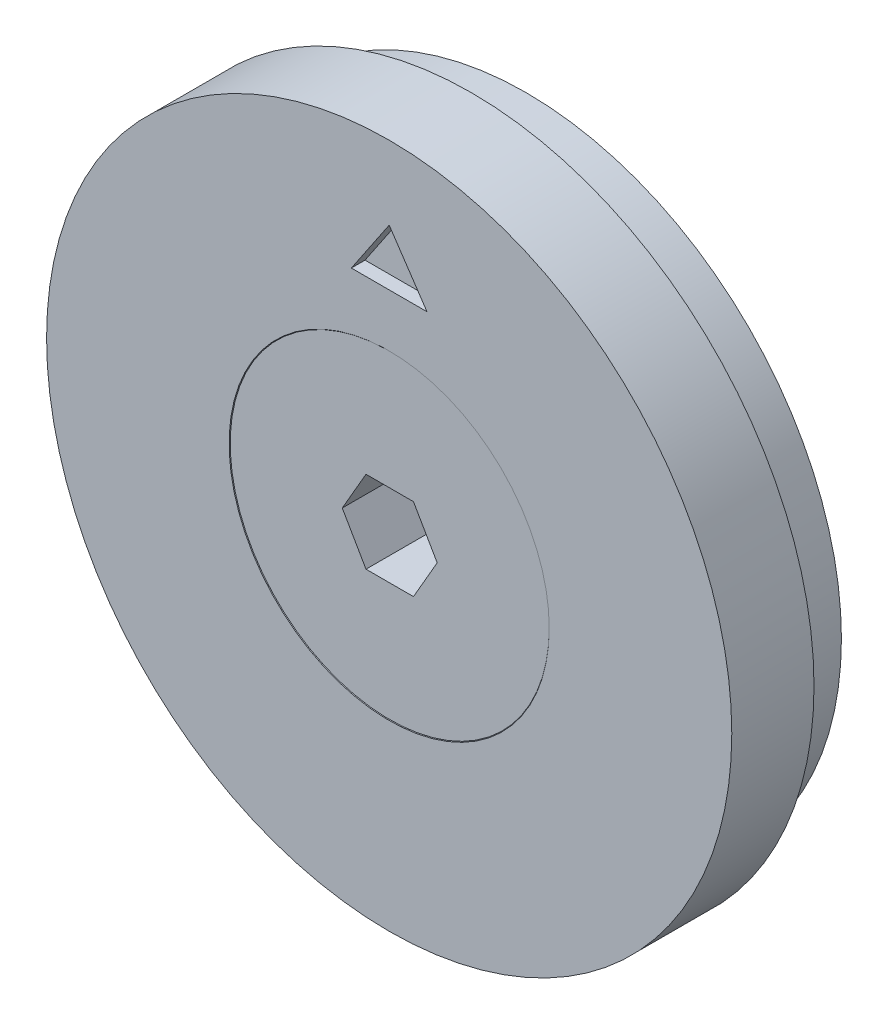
ISO-10303-21;
HEADER;
FILE_DESCRIPTION(('STEP AP214'),'2;1');
FILE_NAME('part.step','',(''),(''),'','','');
FILE_SCHEMA(('AUTOMOTIVE_DESIGN { 1 0 10303 214 1 1 1 1 }'));
ENDSEC;
DATA;
#1=APPLICATION_CONTEXT('core data for automotive mechanical design processes');
#2=APPLICATION_PROTOCOL_DEFINITION('international standard','automotive_design',2000,#1);
#3=PRODUCT_CONTEXT('',#1,'mechanical');
#4=PRODUCT('Part','Part','',(#3));
#5=PRODUCT_RELATED_PRODUCT_CATEGORY('part','',(#4));
#6=PRODUCT_DEFINITION_FORMATION('','',#4);
#7=PRODUCT_DEFINITION_CONTEXT('part definition',#1,'design');
#8=PRODUCT_DEFINITION('design','',#6,#7);
#9=PRODUCT_DEFINITION_SHAPE('','',#8);
#10=(LENGTH_UNIT() NAMED_UNIT(*) SI_UNIT(.MILLI.,.METRE.));
#11=(NAMED_UNIT(*) PLANE_ANGLE_UNIT() SI_UNIT($,.RADIAN.));
#12=(NAMED_UNIT(*) SI_UNIT($,.STERADIAN.) SOLID_ANGLE_UNIT());
#13=UNCERTAINTY_MEASURE_WITH_UNIT(LENGTH_MEASURE(1.E-05),#10,'distance_accuracy_value','');
#14=(GEOMETRIC_REPRESENTATION_CONTEXT(3) GLOBAL_UNCERTAINTY_ASSIGNED_CONTEXT((#13)) GLOBAL_UNIT_ASSIGNED_CONTEXT((#10,
#11,#12)) REPRESENTATION_CONTEXT('',''));
#15=CARTESIAN_POINT('',(0.,0.,0.));
#16=DIRECTION('',(0.,0.,1.));
#17=DIRECTION('',(1.,0.,0.));
#18=AXIS2_PLACEMENT_3D('',#15,#16,#17);
#19=CARTESIAN_POINT('',(0.,0.,-0.0199999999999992));
#20=DIRECTION('',(0.,0.,1.));
#21=DIRECTION('',(1.,0.,0.));
#22=AXIS2_PLACEMENT_3D('',#19,#20,#21);
#23=CYLINDRICAL_SURFACE('',#22,2.5);
#24=CARTESIAN_POINT('',(0.,0.,-3.34));
#25=DIRECTION('',(0.,0.,1.));
#26=DIRECTION('',(1.,0.,0.));
#27=AXIS2_PLACEMENT_3D('',#24,#25,#26);
#28=CIRCLE('',#27,2.5);
#29=CARTESIAN_POINT('',(2.5,0.,-3.34));
#30=VERTEX_POINT('',#29);
#31=EDGE_CURVE('P0_E11',#30,#30,#28,.T.);
#32=ORIENTED_EDGE('',*,*,#31,.F.);
#33=EDGE_LOOP('',(#32));
#34=FACE_BOUND('',#33,.T.);
#35=CARTESIAN_POINT('',(0.,0.,-9.77));
#36=DIRECTION('',(0.,0.,1.));
#37=DIRECTION('',(1.,0.,0.));
#38=AXIS2_PLACEMENT_3D('',#35,#36,#37);
#39=CIRCLE('',#38,2.5);
#40=CARTESIAN_POINT('',(2.5,0.,-9.77));
#41=VERTEX_POINT('',#40);
#42=EDGE_CURVE('P0_E136',#41,#41,#39,.T.);
#43=ORIENTED_EDGE('',*,*,#42,.T.);
#44=EDGE_LOOP('',(#43));
#45=FACE_BOUND('',#44,.T.);
#46=ADVANCED_FACE('P0_F35',(#34,#45),#23,.T.);
#47=CARTESIAN_POINT('',(0.,0.,-3.34));
#48=DIRECTION('',(0.,0.,1.));
#49=DIRECTION('',(1.,0.,0.));
#50=AXIS2_PLACEMENT_3D('',#47,#48,#49);
#51=CONICAL_SURFACE('',#50,2.5,0.785398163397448);
#52=CARTESIAN_POINT('',(0.,0.,-0.0199999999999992));
#53=DIRECTION('',(0.,0.,1.));
#54=DIRECTION('',(1.,0.,0.));
#55=AXIS2_PLACEMENT_3D('',#52,#53,#54);
#56=CIRCLE('',#55,5.82);
#57=CARTESIAN_POINT('',(5.82,0.,-0.0199999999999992));
#58=VERTEX_POINT('',#57);
#59=EDGE_CURVE('P0_E42',#58,#58,#56,.T.);
#60=ORIENTED_EDGE('',*,*,#59,.F.);
#61=EDGE_LOOP('',(#60));
#62=FACE_BOUND('',#61,.T.);
#63=ORIENTED_EDGE('',*,*,#31,.T.);
#64=EDGE_LOOP('',(#63));
#65=FACE_BOUND('',#64,.T.);
#66=ADVANCED_FACE('P0_F151',(#62,#65),#51,.T.);
#67=CARTESIAN_POINT('',(0.,5.82,-0.0199999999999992));
#68=DIRECTION('',(0.,0.,-1.));
#69=DIRECTION('',(-1.,0.,0.));
#70=AXIS2_PLACEMENT_3D('',#67,#68,#69);
#71=PLANE('',#70);
#72=DIRECTION('',(1.,0.,0.));
#73=VECTOR('',#72,1.);
#74=CARTESIAN_POINT('',(-0.866025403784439,-1.5,-0.0199999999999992));
#75=LINE('',#74,#73);
#76=CARTESIAN_POINT('',(-0.866025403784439,-1.5,-0.0199999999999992));
#77=VERTEX_POINT('',#76);
#78=CARTESIAN_POINT('',(0.866025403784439,-1.5,-0.0199999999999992));
#79=VERTEX_POINT('',#78);
#80=EDGE_CURVE('P0_E123',#77,#79,#75,.T.);
#81=ORIENTED_EDGE('',*,*,#80,.F.);
#82=DIRECTION('',(0.5,-0.866025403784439,0.));
#83=VECTOR('',#82,1.);
#84=CARTESIAN_POINT('',(-1.73205080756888,0.,-0.0199999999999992));
#85=LINE('',#84,#83);
#86=CARTESIAN_POINT('',(-1.73205080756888,0.,-0.0199999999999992));
#87=VERTEX_POINT('',#86);
#88=EDGE_CURVE('P0_E49',#87,#77,#85,.T.);
#89=ORIENTED_EDGE('',*,*,#88,.F.);
#90=DIRECTION('',(-0.5,-0.866025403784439,0.));
#91=VECTOR('',#90,1.);
#92=CARTESIAN_POINT('',(-0.866025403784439,1.5,-0.0199999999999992));
#93=LINE('',#92,#91);
#94=CARTESIAN_POINT('',(-0.866025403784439,1.5,-0.0199999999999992));
#95=VERTEX_POINT('',#94);
#96=EDGE_CURVE('P0_E132',#95,#87,#93,.T.);
#97=ORIENTED_EDGE('',*,*,#96,.F.);
#98=DIRECTION('',(-1.,0.,0.));
#99=VECTOR('',#98,1.);
#100=CARTESIAN_POINT('',(0.866025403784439,1.5,-0.0199999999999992));
#101=LINE('',#100,#99);
#102=CARTESIAN_POINT('',(0.866025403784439,1.5,-0.0199999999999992));
#103=VERTEX_POINT('',#102);
#104=EDGE_CURVE('P0_E130',#103,#95,#101,.T.);
#105=ORIENTED_EDGE('',*,*,#104,.F.);
#106=DIRECTION('',(-0.5,0.866025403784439,0.));
#107=VECTOR('',#106,1.);
#108=CARTESIAN_POINT('',(1.73205080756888,0.,-0.0199999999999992));
#109=LINE('',#108,#107);
#110=CARTESIAN_POINT('',(1.73205080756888,0.,-0.0199999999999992));
#111=VERTEX_POINT('',#110);
#112=EDGE_CURVE('P0_E97',#111,#103,#109,.T.);
#113=ORIENTED_EDGE('',*,*,#112,.F.);
#114=DIRECTION('',(0.5,0.866025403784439,0.));
#115=VECTOR('',#114,1.);
#116=CARTESIAN_POINT('',(0.866025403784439,-1.5,-0.0199999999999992));
#117=LINE('',#116,#115);
#118=EDGE_CURVE('P0_E126',#79,#111,#117,.T.);
#119=ORIENTED_EDGE('',*,*,#118,.F.);
#120=EDGE_LOOP('',(#81,#89,#97,#105,#113,#119));
#121=FACE_BOUND('',#120,.T.);
#122=ORIENTED_EDGE('',*,*,#59,.T.);
#123=EDGE_LOOP('',(#122));
#124=FACE_BOUND('',#123,.T.);
#125=ADVANCED_FACE('P0_F149',(#121,#124),#71,.F.);
#126=CARTESIAN_POINT('',(0.,0.,-10.02));
#127=DIRECTION('',(0.,0.,1.));
#128=DIRECTION('',(1.,0.,0.));
#129=AXIS2_PLACEMENT_3D('',#126,#127,#128);
#130=PLANE('',#129);
#131=CARTESIAN_POINT('',(0.,0.,-10.02));
#132=DIRECTION('',(0.,0.,1.));
#133=DIRECTION('',(1.,0.,0.));
#134=AXIS2_PLACEMENT_3D('',#131,#132,#133);
#135=CIRCLE('',#134,2.25);
#136=CARTESIAN_POINT('',(2.25,0.,-10.02));
#137=VERTEX_POINT('',#136);
#138=EDGE_CURVE('P0_E144',#137,#137,#135,.T.);
#139=ORIENTED_EDGE('',*,*,#138,.F.);
#140=EDGE_LOOP('',(#139));
#141=FACE_BOUND('',#140,.T.);
#142=ADVANCED_FACE('P0_F164',(#141),#130,.F.);
#143=CARTESIAN_POINT('',(0.,0.,-10.02));
#144=DIRECTION('',(0.,0.,1.));
#145=DIRECTION('',(1.,0.,0.));
#146=AXIS2_PLACEMENT_3D('',#143,#144,#145);
#147=CONICAL_SURFACE('',#146,2.25,0.78539816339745);
#148=ORIENTED_EDGE('',*,*,#42,.F.);
#149=EDGE_LOOP('',(#148));
#150=FACE_BOUND('',#149,.T.);
#151=ORIENTED_EDGE('',*,*,#138,.T.);
#152=EDGE_LOOP('',(#151));
#153=FACE_BOUND('',#152,.T.);
#154=ADVANCED_FACE('P0_F160',(#150,#153),#147,.T.);
#155=CARTESIAN_POINT('',(-1.73205080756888,0.,-2.52));
#156=DIRECTION('',(-0.866025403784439,-0.5,0.));
#157=DIRECTION('',(0.5,-0.866025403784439,0.));
#158=AXIS2_PLACEMENT_3D('',#155,#156,#157);
#159=PLANE('',#158);
#160=ORIENTED_EDGE('',*,*,#88,.T.);
#161=DIRECTION('',(0.,0.,1.));
#162=VECTOR('',#161,1.);
#163=CARTESIAN_POINT('',(-0.866025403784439,-1.5,-2.52));
#164=LINE('',#163,#162);
#165=CARTESIAN_POINT('',(-0.866025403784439,-1.5,-2.52));
#166=VERTEX_POINT('',#165);
#167=EDGE_CURVE('P0_E79',#166,#77,#164,.T.);
#168=ORIENTED_EDGE('',*,*,#167,.F.);
#169=DIRECTION('',(0.5,-0.866025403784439,0.));
#170=VECTOR('',#169,1.);
#171=CARTESIAN_POINT('',(-1.73205080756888,0.,-2.52));
#172=LINE('',#171,#170);
#173=CARTESIAN_POINT('',(-1.73205080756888,0.,-2.52));
#174=VERTEX_POINT('',#173);
#175=EDGE_CURVE('P0_E134',#174,#166,#172,.T.);
#176=ORIENTED_EDGE('',*,*,#175,.F.);
#177=DIRECTION('',(0.,0.,1.));
#178=VECTOR('',#177,1.);
#179=CARTESIAN_POINT('',(-1.73205080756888,0.,-2.52));
#180=LINE('',#179,#178);
#181=EDGE_CURVE('P0_E57',#174,#87,#180,.T.);
#182=ORIENTED_EDGE('',*,*,#181,.T.);
#183=EDGE_LOOP('',(#160,#168,#176,#182));
#184=FACE_BOUND('',#183,.T.);
#185=ADVANCED_FACE('P0_F163',(#184),#159,.F.);
#186=CARTESIAN_POINT('',(-0.866025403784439,1.5,-2.52));
#187=DIRECTION('',(-0.866025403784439,0.5,0.));
#188=DIRECTION('',(-0.5,-0.866025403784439,0.));
#189=AXIS2_PLACEMENT_3D('',#186,#187,#188);
#190=PLANE('',#189);
#191=ORIENTED_EDGE('',*,*,#96,.T.);
#192=ORIENTED_EDGE('',*,*,#181,.F.);
#193=DIRECTION('',(-0.5,-0.866025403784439,0.));
#194=VECTOR('',#193,1.);
#195=CARTESIAN_POINT('',(-0.866025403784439,1.5,-2.52));
#196=LINE('',#195,#194);
#197=CARTESIAN_POINT('',(-0.866025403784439,1.5,-2.52));
#198=VERTEX_POINT('',#197);
#199=EDGE_CURVE('P0_E109',#198,#174,#196,.T.);
#200=ORIENTED_EDGE('',*,*,#199,.F.);
#201=DIRECTION('',(0.,0.,1.));
#202=VECTOR('',#201,1.);
#203=CARTESIAN_POINT('',(-0.866025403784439,1.5,-2.52));
#204=LINE('',#203,#202);
#205=EDGE_CURVE('P0_E101',#198,#95,#204,.T.);
#206=ORIENTED_EDGE('',*,*,#205,.T.);
#207=EDGE_LOOP('',(#191,#192,#200,#206));
#208=FACE_BOUND('',#207,.T.);
#209=ADVANCED_FACE('P0_F179',(#208),#190,.F.);
#210=CARTESIAN_POINT('',(0.866025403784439,1.5,-2.52));
#211=DIRECTION('',(0.,1.,0.));
#212=DIRECTION('',(-1.,0.,0.));
#213=AXIS2_PLACEMENT_3D('',#210,#211,#212);
#214=PLANE('',#213);
#215=ORIENTED_EDGE('',*,*,#104,.T.);
#216=ORIENTED_EDGE('',*,*,#205,.F.);
#217=DIRECTION('',(-1.,0.,0.));
#218=VECTOR('',#217,1.);
#219=CARTESIAN_POINT('',(0.866025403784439,1.5,-2.52));
#220=LINE('',#219,#218);
#221=CARTESIAN_POINT('',(0.866025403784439,1.5,-2.52));
#222=VERTEX_POINT('',#221);
#223=EDGE_CURVE('P0_E105',#222,#198,#220,.T.);
#224=ORIENTED_EDGE('',*,*,#223,.F.);
#225=DIRECTION('',(0.,0.,1.));
#226=VECTOR('',#225,1.);
#227=CARTESIAN_POINT('',(0.866025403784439,1.5,-2.52));
#228=LINE('',#227,#226);
#229=EDGE_CURVE('P0_E90',#222,#103,#228,.T.);
#230=ORIENTED_EDGE('',*,*,#229,.T.);
#231=EDGE_LOOP('',(#215,#216,#224,#230));
#232=FACE_BOUND('',#231,.T.);
#233=ADVANCED_FACE('P0_F106',(#232),#214,.F.);
#234=CARTESIAN_POINT('',(1.73205080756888,0.,-2.52));
#235=DIRECTION('',(0.866025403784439,0.5,0.));
#236=DIRECTION('',(-0.5,0.866025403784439,0.));
#237=AXIS2_PLACEMENT_3D('',#234,#235,#236);
#238=PLANE('',#237);
#239=ORIENTED_EDGE('',*,*,#112,.T.);
#240=ORIENTED_EDGE('',*,*,#229,.F.);
#241=DIRECTION('',(-0.5,0.866025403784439,0.));
#242=VECTOR('',#241,1.);
#243=CARTESIAN_POINT('',(1.73205080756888,0.,-2.52));
#244=LINE('',#243,#242);
#245=CARTESIAN_POINT('',(1.73205080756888,0.,-2.52));
#246=VERTEX_POINT('',#245);
#247=EDGE_CURVE('P0_E94',#246,#222,#244,.T.);
#248=ORIENTED_EDGE('',*,*,#247,.F.);
#249=DIRECTION('',(0.,0.,1.));
#250=VECTOR('',#249,1.);
#251=CARTESIAN_POINT('',(1.73205080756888,0.,-2.52));
#252=LINE('',#251,#250);
#253=EDGE_CURVE('P0_E102',#246,#111,#252,.T.);
#254=ORIENTED_EDGE('',*,*,#253,.T.);
#255=EDGE_LOOP('',(#239,#240,#248,#254));
#256=FACE_BOUND('',#255,.T.);
#257=ADVANCED_FACE('P0_F92',(#256),#238,.F.);
#258=CARTESIAN_POINT('',(0.866025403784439,-1.5,-2.52));
#259=DIRECTION('',(0.866025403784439,-0.5,0.));
#260=DIRECTION('',(0.5,0.866025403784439,0.));
#261=AXIS2_PLACEMENT_3D('',#258,#259,#260);
#262=PLANE('',#261);
#263=ORIENTED_EDGE('',*,*,#118,.T.);
#264=ORIENTED_EDGE('',*,*,#253,.F.);
#265=DIRECTION('',(0.5,0.866025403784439,0.));
#266=VECTOR('',#265,1.);
#267=CARTESIAN_POINT('',(0.866025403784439,-1.5,-2.52));
#268=LINE('',#267,#266);
#269=CARTESIAN_POINT('',(0.866025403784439,-1.5,-2.52));
#270=VERTEX_POINT('',#269);
#271=EDGE_CURVE('P0_E115',#270,#246,#268,.T.);
#272=ORIENTED_EDGE('',*,*,#271,.F.);
#273=DIRECTION('',(0.,0.,1.));
#274=VECTOR('',#273,1.);
#275=CARTESIAN_POINT('',(0.866025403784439,-1.5,-2.52));
#276=LINE('',#275,#274);
#277=EDGE_CURVE('P0_E139',#270,#79,#276,.T.);
#278=ORIENTED_EDGE('',*,*,#277,.T.);
#279=EDGE_LOOP('',(#263,#264,#272,#278));
#280=FACE_BOUND('',#279,.T.);
#281=ADVANCED_FACE('P0_F183',(#280),#262,.F.);
#282=CARTESIAN_POINT('',(-0.866025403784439,-1.5,-2.52));
#283=DIRECTION('',(0.,-1.,0.));
#284=DIRECTION('',(0.,0.,-1.));
#285=AXIS2_PLACEMENT_3D('',#282,#283,#284);
#286=PLANE('',#285);
#287=ORIENTED_EDGE('',*,*,#80,.T.);
#288=ORIENTED_EDGE('',*,*,#277,.F.);
#289=DIRECTION('',(1.,0.,0.));
#290=VECTOR('',#289,1.);
#291=CARTESIAN_POINT('',(-0.866025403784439,-1.5,-2.52));
#292=LINE('',#291,#290);
#293=EDGE_CURVE('P0_E117',#166,#270,#292,.T.);
#294=ORIENTED_EDGE('',*,*,#293,.F.);
#295=ORIENTED_EDGE('',*,*,#167,.T.);
#296=EDGE_LOOP('',(#287,#288,#294,#295));
#297=FACE_BOUND('',#296,.T.);
#298=ADVANCED_FACE('P0_F180',(#297),#286,.F.);
#299=CARTESIAN_POINT('',(0.,0.,-2.52));
#300=DIRECTION('',(0.,0.,1.));
#301=DIRECTION('',(1.,0.,0.));
#302=AXIS2_PLACEMENT_3D('',#299,#300,#301);
#303=PLANE('',#302);
#304=ORIENTED_EDGE('',*,*,#175,.T.);
#305=ORIENTED_EDGE('',*,*,#293,.T.);
#306=ORIENTED_EDGE('',*,*,#271,.T.);
#307=ORIENTED_EDGE('',*,*,#247,.T.);
#308=ORIENTED_EDGE('',*,*,#223,.T.);
#309=ORIENTED_EDGE('',*,*,#199,.T.);
#310=EDGE_LOOP('',(#304,#305,#306,#307,#308,#309));
#311=FACE_BOUND('',#310,.T.);
#312=ADVANCED_FACE('P0_F112',(#311),#303,.T.);
#313=CLOSED_SHELL('',(#46,#66,#125,#142,#154,#185,#209,#233,#257,#281,#298,#312));
#314=MANIFOLD_SOLID_BREP('P0_B2',#313);
#315=CARTESIAN_POINT('',(0.,0.,3.12219627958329));
#316=DIRECTION('',(0.,0.,1.));
#317=DIRECTION('',(1.,0.,0.));
#318=AXIS2_PLACEMENT_3D('',#315,#316,#317);
#319=CYLINDRICAL_SURFACE('',#318,12.5);
#320=CARTESIAN_POINT('',(0.,0.,0.));
#321=DIRECTION('',(0.,0.,1.));
#322=DIRECTION('',(1.,0.,0.));
#323=AXIS2_PLACEMENT_3D('',#320,#321,#322);
#324=CIRCLE('',#323,12.5);
#325=CARTESIAN_POINT('',(12.5,0.,0.));
#326=VERTEX_POINT('',#325);
#327=EDGE_CURVE('P1_E11',#326,#326,#324,.T.);
#328=ORIENTED_EDGE('',*,*,#327,.F.);
#329=EDGE_LOOP('',(#328));
#330=FACE_BOUND('',#329,.T.);
#331=CARTESIAN_POINT('',(0.,0.,-3.));
#332=DIRECTION('',(0.,0.,1.));
#333=DIRECTION('',(1.,0.,0.));
#334=AXIS2_PLACEMENT_3D('',#331,#332,#333);
#335=CIRCLE('',#334,12.5);
#336=CARTESIAN_POINT('',(12.5,0.,-3.));
#337=VERTEX_POINT('',#336);
#338=EDGE_CURVE('P1_E76',#337,#337,#335,.T.);
#339=ORIENTED_EDGE('',*,*,#338,.T.);
#340=EDGE_LOOP('',(#339));
#341=FACE_BOUND('',#340,.T.);
#342=ADVANCED_FACE('P1_F17',(#330,#341),#319,.T.);
#343=CARTESIAN_POINT('',(0.,12.5,0.));
#344=DIRECTION('',(0.,0.,-1.));
#345=DIRECTION('',(-1.,0.,0.));
#346=AXIS2_PLACEMENT_3D('',#343,#344,#345);
#347=PLANE('',#346);
#348=DIRECTION('',(-0.559192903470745,0.829037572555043,0.));
#349=VECTOR('',#348,1.);
#350=CARTESIAN_POINT('',(1.3800444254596,7.76799984,0.));
#351=LINE('',#350,#349);
#352=CARTESIAN_POINT('',(1.3800444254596,7.76799984,0.));
#353=VERTEX_POINT('',#352);
#354=CARTESIAN_POINT('',(0.,9.81399984,0.));
#355=VERTEX_POINT('',#354);
#356=EDGE_CURVE('P1_E69',#353,#355,#351,.T.);
#357=ORIENTED_EDGE('',*,*,#356,.F.);
#358=DIRECTION('',(1.,0.,0.));
#359=VECTOR('',#358,1.);
#360=CARTESIAN_POINT('',(-1.3800444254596,7.76799984,0.));
#361=LINE('',#360,#359);
#362=CARTESIAN_POINT('',(-1.3800444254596,7.76799984,0.));
#363=VERTEX_POINT('',#362);
#364=EDGE_CURVE('P1_E31',#363,#353,#361,.T.);
#365=ORIENTED_EDGE('',*,*,#364,.F.);
#366=DIRECTION('',(-0.559192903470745,-0.829037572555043,0.));
#367=VECTOR('',#366,1.);
#368=CARTESIAN_POINT('',(0.,9.81399984,0.));
#369=LINE('',#368,#367);
#370=EDGE_CURVE('P1_E67',#355,#363,#369,.T.);
#371=ORIENTED_EDGE('',*,*,#370,.F.);
#372=EDGE_LOOP('',(#357,#365,#371));
#373=FACE_BOUND('',#372,.T.);
#374=CARTESIAN_POINT('',(0.,0.,0.));
#375=DIRECTION('',(0.,0.,1.));
#376=DIRECTION('',(1.,0.,0.));
#377=AXIS2_PLACEMENT_3D('',#374,#375,#376);
#378=CIRCLE('',#377,5.84);
#379=CARTESIAN_POINT('',(5.84,0.,0.));
#380=VERTEX_POINT('',#379);
#381=EDGE_CURVE('P1_E24',#380,#380,#378,.T.);
#382=ORIENTED_EDGE('',*,*,#381,.F.);
#383=EDGE_LOOP('',(#382));
#384=FACE_BOUND('',#383,.T.);
#385=ORIENTED_EDGE('',*,*,#327,.T.);
#386=EDGE_LOOP('',(#385));
#387=FACE_BOUND('',#386,.T.);
#388=ADVANCED_FACE('P1_F96',(#373,#384,#387),#347,.F.);
#389=CARTESIAN_POINT('',(0.,0.,0.));
#390=DIRECTION('',(0.,0.,1.));
#391=DIRECTION('',(1.,0.,0.));
#392=AXIS2_PLACEMENT_3D('',#389,#390,#391);
#393=CONICAL_SURFACE('',#392,5.84,0.785398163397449);
#394=CARTESIAN_POINT('',(0.,0.,-3.34));
#395=DIRECTION('',(0.,0.,1.));
#396=DIRECTION('',(1.,0.,0.));
#397=AXIS2_PLACEMENT_3D('',#394,#395,#396);
#398=CIRCLE('',#397,2.5);
#399=CARTESIAN_POINT('',(2.5,0.,-3.34));
#400=VERTEX_POINT('',#399);
#401=EDGE_CURVE('P1_E89',#400,#400,#398,.T.);
#402=ORIENTED_EDGE('',*,*,#401,.F.);
#403=EDGE_LOOP('',(#402));
#404=FACE_BOUND('',#403,.T.);
#405=ORIENTED_EDGE('',*,*,#381,.T.);
#406=EDGE_LOOP('',(#405));
#407=FACE_BOUND('',#406,.T.);
#408=ADVANCED_FACE('P1_F94',(#404,#407),#393,.F.);
#409=CARTESIAN_POINT('',(0.,0.,3.12219627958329));
#410=DIRECTION('',(0.,0.,1.));
#411=DIRECTION('',(1.,0.,0.));
#412=AXIS2_PLACEMENT_3D('',#409,#410,#411);
#413=CYLINDRICAL_SURFACE('',#412,2.5);
#414=CARTESIAN_POINT('',(0.,0.,-5.));
#415=DIRECTION('',(0.,0.,1.));
#416=DIRECTION('',(1.,0.,0.));
#417=AXIS2_PLACEMENT_3D('',#414,#415,#416);
#418=CIRCLE('',#417,2.5);
#419=CARTESIAN_POINT('',(2.5,0.,-5.));
#420=VERTEX_POINT('',#419);
#421=EDGE_CURVE('P1_E86',#420,#420,#418,.T.);
#422=ORIENTED_EDGE('',*,*,#421,.F.);
#423=EDGE_LOOP('',(#422));
#424=FACE_BOUND('',#423,.T.);
#425=ORIENTED_EDGE('',*,*,#401,.T.);
#426=EDGE_LOOP('',(#425));
#427=FACE_BOUND('',#426,.T.);
#428=ADVANCED_FACE('P1_F121',(#424,#427),#413,.F.);
#429=CARTESIAN_POINT('',(0.,2.5,-5.));
#430=DIRECTION('',(0.,0.,1.));
#431=DIRECTION('',(1.,0.,0.));
#432=AXIS2_PLACEMENT_3D('',#429,#430,#431);
#433=PLANE('',#432);
#434=CARTESIAN_POINT('',(0.,0.,-5.));
#435=DIRECTION('',(0.,0.,1.));
#436=DIRECTION('',(1.,0.,0.));
#437=AXIS2_PLACEMENT_3D('',#434,#435,#436);
#438=CIRCLE('',#437,11.5);
#439=CARTESIAN_POINT('',(11.5,0.,-5.));
#440=VERTEX_POINT('',#439);
#441=EDGE_CURVE('P1_E83',#440,#440,#438,.T.);
#442=ORIENTED_EDGE('',*,*,#441,.F.);
#443=EDGE_LOOP('',(#442));
#444=FACE_BOUND('',#443,.T.);
#445=ORIENTED_EDGE('',*,*,#421,.T.);
#446=EDGE_LOOP('',(#445));
#447=FACE_BOUND('',#446,.T.);
#448=ADVANCED_FACE('P1_F115',(#444,#447),#433,.F.);
#449=CARTESIAN_POINT('',(0.,0.,3.12219627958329));
#450=DIRECTION('',(0.,0.,1.));
#451=DIRECTION('',(1.,0.,0.));
#452=AXIS2_PLACEMENT_3D('',#449,#450,#451);
#453=CYLINDRICAL_SURFACE('',#452,11.5);
#454=CARTESIAN_POINT('',(0.,0.,-3.));
#455=DIRECTION('',(0.,0.,1.));
#456=DIRECTION('',(1.,0.,0.));
#457=AXIS2_PLACEMENT_3D('',#454,#455,#456);
#458=CIRCLE('',#457,11.5);
#459=CARTESIAN_POINT('',(11.5,0.,-3.));
#460=VERTEX_POINT('',#459);
#461=EDGE_CURVE('P1_E80',#460,#460,#458,.T.);
#462=ORIENTED_EDGE('',*,*,#461,.F.);
#463=EDGE_LOOP('',(#462));
#464=FACE_BOUND('',#463,.T.);
#465=ORIENTED_EDGE('',*,*,#441,.T.);
#466=EDGE_LOOP('',(#465));
#467=FACE_BOUND('',#466,.T.);
#468=ADVANCED_FACE('P1_F109',(#464,#467),#453,.T.);
#469=CARTESIAN_POINT('',(0.,11.5,-3.));
#470=DIRECTION('',(0.,0.,1.));
#471=DIRECTION('',(1.,0.,0.));
#472=AXIS2_PLACEMENT_3D('',#469,#470,#471);
#473=PLANE('',#472);
#474=ORIENTED_EDGE('',*,*,#338,.F.);
#475=EDGE_LOOP('',(#474));
#476=FACE_BOUND('',#475,.T.);
#477=ORIENTED_EDGE('',*,*,#461,.T.);
#478=EDGE_LOOP('',(#477));
#479=FACE_BOUND('',#478,.T.);
#480=ADVANCED_FACE('P1_F106',(#476,#479),#473,.F.);
#481=CARTESIAN_POINT('',(-1.3800444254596,7.76799984,-0.5));
#482=DIRECTION('',(0.,-1.,0.));
#483=DIRECTION('',(0.,0.,-1.));
#484=AXIS2_PLACEMENT_3D('',#481,#482,#483);
#485=PLANE('',#484);
#486=ORIENTED_EDGE('',*,*,#364,.T.);
#487=DIRECTION('',(0.,0.,1.));
#488=VECTOR('',#487,1.);
#489=CARTESIAN_POINT('',(1.3800444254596,7.76799984,-0.5));
#490=LINE('',#489,#488);
#491=CARTESIAN_POINT('',(1.3800444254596,7.76799984,-0.5));
#492=VERTEX_POINT('',#491);
#493=EDGE_CURVE('P1_E49',#492,#353,#490,.T.);
#494=ORIENTED_EDGE('',*,*,#493,.F.);
#495=DIRECTION('',(1.,0.,0.));
#496=VECTOR('',#495,1.);
#497=CARTESIAN_POINT('',(-1.3800444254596,7.76799984,-0.5));
#498=LINE('',#497,#496);
#499=CARTESIAN_POINT('',(-1.3800444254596,7.76799984,-0.5));
#500=VERTEX_POINT('',#499);
#501=EDGE_CURVE('P1_E53',#500,#492,#498,.T.);
#502=ORIENTED_EDGE('',*,*,#501,.F.);
#503=DIRECTION('',(0.,0.,1.));
#504=VECTOR('',#503,1.);
#505=CARTESIAN_POINT('',(-1.3800444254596,7.76799984,-0.5));
#506=LINE('',#505,#504);
#507=EDGE_CURVE('P1_E39',#500,#363,#506,.T.);
#508=ORIENTED_EDGE('',*,*,#507,.T.);
#509=EDGE_LOOP('',(#486,#494,#502,#508));
#510=FACE_BOUND('',#509,.T.);
#511=ADVANCED_FACE('P1_F51',(#510),#485,.F.);
#512=CARTESIAN_POINT('',(0.,9.81399984,-0.5));
#513=DIRECTION('',(-0.829037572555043,0.559192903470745,0.));
#514=DIRECTION('',(-0.559192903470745,-0.829037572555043,0.));
#515=AXIS2_PLACEMENT_3D('',#512,#513,#514);
#516=PLANE('',#515);
#517=ORIENTED_EDGE('',*,*,#370,.T.);
#518=ORIENTED_EDGE('',*,*,#507,.F.);
#519=DIRECTION('',(-0.559192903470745,-0.829037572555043,0.));
#520=VECTOR('',#519,1.);
#521=CARTESIAN_POINT('',(0.,9.81399984,-0.5));
#522=LINE('',#521,#520);
#523=CARTESIAN_POINT('',(0.,9.81399984,-0.5));
#524=VERTEX_POINT('',#523);
#525=EDGE_CURVE('P1_E59',#524,#500,#522,.T.);
#526=ORIENTED_EDGE('',*,*,#525,.F.);
#527=DIRECTION('',(0.,0.,1.));
#528=VECTOR('',#527,1.);
#529=CARTESIAN_POINT('',(0.,9.81399984,-0.5));
#530=LINE('',#529,#528);
#531=EDGE_CURVE('P1_E58',#524,#355,#530,.T.);
#532=ORIENTED_EDGE('',*,*,#531,.T.);
#533=EDGE_LOOP('',(#517,#518,#526,#532));
#534=FACE_BOUND('',#533,.T.);
#535=ADVANCED_FACE('P1_F139',(#534),#516,.F.);
#536=CARTESIAN_POINT('',(1.3800444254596,7.76799984,-0.5));
#537=DIRECTION('',(0.829037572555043,0.559192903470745,0.));
#538=DIRECTION('',(-0.559192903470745,0.829037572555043,0.));
#539=AXIS2_PLACEMENT_3D('',#536,#537,#538);
#540=PLANE('',#539);
#541=ORIENTED_EDGE('',*,*,#356,.T.);
#542=ORIENTED_EDGE('',*,*,#531,.F.);
#543=DIRECTION('',(-0.559192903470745,0.829037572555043,0.));
#544=VECTOR('',#543,1.);
#545=CARTESIAN_POINT('',(1.3800444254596,7.76799984,-0.5));
#546=LINE('',#545,#544);
#547=EDGE_CURVE('P1_E62',#492,#524,#546,.T.);
#548=ORIENTED_EDGE('',*,*,#547,.F.);
#549=ORIENTED_EDGE('',*,*,#493,.T.);
#550=EDGE_LOOP('',(#541,#542,#548,#549));
#551=FACE_BOUND('',#550,.T.);
#552=ADVANCED_FACE('P1_F63',(#551),#540,.F.);
#553=CARTESIAN_POINT('',(1.3800444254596,7.76799984,-0.5));
#554=DIRECTION('',(0.,0.,1.));
#555=DIRECTION('',(1.,0.,0.));
#556=AXIS2_PLACEMENT_3D('',#553,#554,#555);
#557=PLANE('',#556);
#558=ORIENTED_EDGE('',*,*,#501,.T.);
#559=ORIENTED_EDGE('',*,*,#547,.T.);
#560=ORIENTED_EDGE('',*,*,#525,.T.);
#561=EDGE_LOOP('',(#558,#559,#560));
#562=FACE_BOUND('',#561,.T.);
#563=ADVANCED_FACE('P1_F66',(#562),#557,.T.);
#564=CLOSED_SHELL('',(#342,#388,#408,#428,#448,#468,#480,#511,#535,#552,#563));
#565=MANIFOLD_SOLID_BREP('P1_B1',#564);
#566=ADVANCED_BREP_SHAPE_REPRESENTATION('',(#18,#314,#565),#14);
#567=SHAPE_DEFINITION_REPRESENTATION(#9,#566);
ENDSEC;
END-ISO-10303-21;
